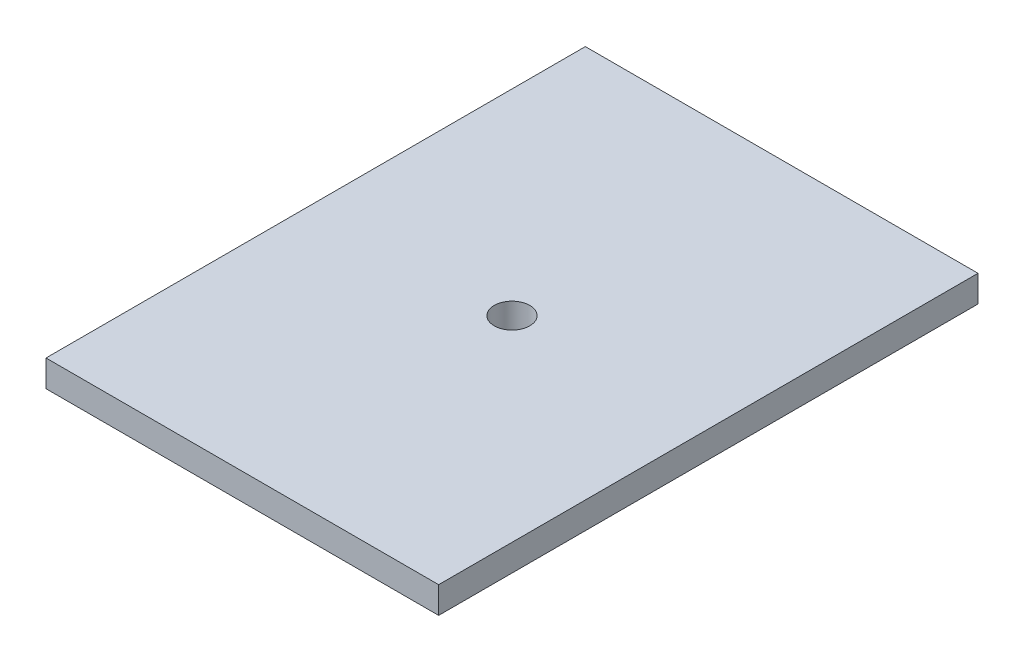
ISO-10303-21;
HEADER;
FILE_DESCRIPTION(('STEP AP214'),'2;1');
FILE_NAME('part.step','',(''),(''),'','','');
FILE_SCHEMA(('AUTOMOTIVE_DESIGN { 1 0 10303 214 1 1 1 1 }'));
ENDSEC;
DATA;
#1=APPLICATION_CONTEXT('core data for automotive mechanical design processes');
#2=APPLICATION_PROTOCOL_DEFINITION('international standard','automotive_design',2000,#1);
#3=PRODUCT_CONTEXT('',#1,'mechanical');
#4=PRODUCT('Part','Part','',(#3));
#5=PRODUCT_RELATED_PRODUCT_CATEGORY('part','',(#4));
#6=PRODUCT_DEFINITION_FORMATION('','',#4);
#7=PRODUCT_DEFINITION_CONTEXT('part definition',#1,'design');
#8=PRODUCT_DEFINITION('design','',#6,#7);
#9=PRODUCT_DEFINITION_SHAPE('','',#8);
#10=(LENGTH_UNIT() NAMED_UNIT(*) SI_UNIT(.MILLI.,.METRE.));
#11=(NAMED_UNIT(*) PLANE_ANGLE_UNIT() SI_UNIT($,.RADIAN.));
#12=(NAMED_UNIT(*) SI_UNIT($,.STERADIAN.) SOLID_ANGLE_UNIT());
#13=UNCERTAINTY_MEASURE_WITH_UNIT(LENGTH_MEASURE(1.E-05),#10,'distance_accuracy_value','');
#14=(GEOMETRIC_REPRESENTATION_CONTEXT(3) GLOBAL_UNCERTAINTY_ASSIGNED_CONTEXT((#13)) GLOBAL_UNIT_ASSIGNED_CONTEXT((#10,
#11,#12)) REPRESENTATION_CONTEXT('',''));
#15=CARTESIAN_POINT('',(0.,0.,0.));
#16=DIRECTION('',(0.,0.,1.));
#17=DIRECTION('',(1.,0.,0.));
#18=AXIS2_PLACEMENT_3D('',#15,#16,#17);
#19=CARTESIAN_POINT('',(22.1190534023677,3.,-30.3827372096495));
#20=DIRECTION('',(-1.,0.,0.));
#21=DIRECTION('',(0.,0.,1.));
#22=AXIS2_PLACEMENT_3D('',#19,#20,#21);
#23=PLANE('',#22);
#24=DIRECTION('',(0.,0.,-1.));
#25=VECTOR('',#24,1.);
#26=CARTESIAN_POINT('',(22.1190534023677,0.,-30.3827372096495));
#27=LINE('',#26,#25);
#28=CARTESIAN_POINT('',(22.1190534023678,0.,30.3827372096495));
#29=VERTEX_POINT('',#28);
#30=CARTESIAN_POINT('',(22.1190534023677,0.,-30.3827372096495));
#31=VERTEX_POINT('',#30);
#32=EDGE_CURVE('E96',#29,#31,#27,.T.);
#33=ORIENTED_EDGE('',*,*,#32,.T.);
#34=DIRECTION('',(0.,-1.,0.));
#35=VECTOR('',#34,1.);
#36=CARTESIAN_POINT('',(22.1190534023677,3.,-30.3827372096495));
#37=LINE('',#36,#35);
#38=CARTESIAN_POINT('',(22.1190534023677,3.,-30.3827372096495));
#39=VERTEX_POINT('',#38);
#40=EDGE_CURVE('E11',#39,#31,#37,.T.);
#41=ORIENTED_EDGE('',*,*,#40,.F.);
#42=DIRECTION('',(0.,0.,-1.));
#43=VECTOR('',#42,1.);
#44=CARTESIAN_POINT('',(22.1190534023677,3.,-30.3827372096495));
#45=LINE('',#44,#43);
#46=CARTESIAN_POINT('',(22.1190534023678,3.,30.3827372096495));
#47=VERTEX_POINT('',#46);
#48=EDGE_CURVE('E84',#47,#39,#45,.T.);
#49=ORIENTED_EDGE('',*,*,#48,.F.);
#50=DIRECTION('',(0.,-1.,0.));
#51=VECTOR('',#50,1.);
#52=CARTESIAN_POINT('',(22.1190534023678,3.,30.3827372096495));
#53=LINE('',#52,#51);
#54=EDGE_CURVE('E92',#47,#29,#53,.T.);
#55=ORIENTED_EDGE('',*,*,#54,.T.);
#56=EDGE_LOOP('',(#33,#41,#49,#55));
#57=FACE_BOUND('',#56,.T.);
#58=ADVANCED_FACE('F33',(#57),#23,.F.);
#59=CARTESIAN_POINT('',(-22.1190534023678,3.,-30.3827372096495));
#60=DIRECTION('',(0.,0.,1.));
#61=DIRECTION('',(1.,0.,0.));
#62=AXIS2_PLACEMENT_3D('',#59,#60,#61);
#63=PLANE('',#62);
#64=DIRECTION('',(-1.,0.,0.));
#65=VECTOR('',#64,1.);
#66=CARTESIAN_POINT('',(-22.1190534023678,0.,-30.3827372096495));
#67=LINE('',#66,#65);
#68=CARTESIAN_POINT('',(-22.1190534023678,0.,-30.3827372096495));
#69=VERTEX_POINT('',#68);
#70=EDGE_CURVE('E88',#31,#69,#67,.T.);
#71=ORIENTED_EDGE('',*,*,#70,.T.);
#72=DIRECTION('',(0.,-1.,0.));
#73=VECTOR('',#72,1.);
#74=CARTESIAN_POINT('',(-22.1190534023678,3.,-30.3827372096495));
#75=LINE('',#74,#73);
#76=CARTESIAN_POINT('',(-22.1190534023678,3.,-30.3827372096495));
#77=VERTEX_POINT('',#76);
#78=EDGE_CURVE('E41',#77,#69,#75,.T.);
#79=ORIENTED_EDGE('',*,*,#78,.F.);
#80=DIRECTION('',(-1.,0.,0.));
#81=VECTOR('',#80,1.);
#82=CARTESIAN_POINT('',(-22.1190534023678,3.,-30.3827372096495));
#83=LINE('',#82,#81);
#84=EDGE_CURVE('E79',#39,#77,#83,.T.);
#85=ORIENTED_EDGE('',*,*,#84,.F.);
#86=ORIENTED_EDGE('',*,*,#40,.T.);
#87=EDGE_LOOP('',(#71,#79,#85,#86));
#88=FACE_BOUND('',#87,.T.);
#89=ADVANCED_FACE('F87',(#88),#63,.F.);
#90=CARTESIAN_POINT('',(-22.1190534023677,3.,30.3827372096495));
#91=DIRECTION('',(1.,0.,0.));
#92=DIRECTION('',(0.,0.,-1.));
#93=AXIS2_PLACEMENT_3D('',#90,#91,#92);
#94=PLANE('',#93);
#95=DIRECTION('',(0.,0.,1.));
#96=VECTOR('',#95,1.);
#97=CARTESIAN_POINT('',(-22.1190534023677,0.,30.3827372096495));
#98=LINE('',#97,#96);
#99=CARTESIAN_POINT('',(-22.1190534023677,0.,30.3827372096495));
#100=VERTEX_POINT('',#99);
#101=EDGE_CURVE('E66',#69,#100,#98,.T.);
#102=ORIENTED_EDGE('',*,*,#101,.T.);
#103=DIRECTION('',(0.,-1.,0.));
#104=VECTOR('',#103,1.);
#105=CARTESIAN_POINT('',(-22.1190534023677,3.,30.3827372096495));
#106=LINE('',#105,#104);
#107=CARTESIAN_POINT('',(-22.1190534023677,3.,30.3827372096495));
#108=VERTEX_POINT('',#107);
#109=EDGE_CURVE('E89',#108,#100,#106,.T.);
#110=ORIENTED_EDGE('',*,*,#109,.F.);
#111=DIRECTION('',(0.,0.,1.));
#112=VECTOR('',#111,1.);
#113=CARTESIAN_POINT('',(-22.1190534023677,3.,30.3827372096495));
#114=LINE('',#113,#112);
#115=EDGE_CURVE('E82',#77,#108,#114,.T.);
#116=ORIENTED_EDGE('',*,*,#115,.F.);
#117=ORIENTED_EDGE('',*,*,#78,.T.);
#118=EDGE_LOOP('',(#102,#110,#116,#117));
#119=FACE_BOUND('',#118,.T.);
#120=ADVANCED_FACE('F90',(#119),#94,.F.);
#121=CARTESIAN_POINT('',(-22.1190534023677,3.,30.3827372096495));
#122=DIRECTION('',(0.,0.,-1.));
#123=DIRECTION('',(-1.,0.,0.));
#124=AXIS2_PLACEMENT_3D('',#121,#122,#123);
#125=PLANE('',#124);
#126=DIRECTION('',(1.,0.,0.));
#127=VECTOR('',#126,1.);
#128=CARTESIAN_POINT('',(-22.1190534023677,0.,30.3827372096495));
#129=LINE('',#128,#127);
#130=EDGE_CURVE('E72',#100,#29,#129,.T.);
#131=ORIENTED_EDGE('',*,*,#130,.T.);
#132=ORIENTED_EDGE('',*,*,#54,.F.);
#133=DIRECTION('',(1.,0.,0.));
#134=VECTOR('',#133,1.);
#135=CARTESIAN_POINT('',(-22.1190534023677,3.,30.3827372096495));
#136=LINE('',#135,#134);
#137=EDGE_CURVE('E49',#108,#47,#136,.T.);
#138=ORIENTED_EDGE('',*,*,#137,.F.);
#139=ORIENTED_EDGE('',*,*,#109,.T.);
#140=EDGE_LOOP('',(#131,#132,#138,#139));
#141=FACE_BOUND('',#140,.T.);
#142=ADVANCED_FACE('F104',(#141),#125,.F.);
#143=CARTESIAN_POINT('',(22.1190534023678,3.,30.3827372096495));
#144=DIRECTION('',(0.,1.,0.));
#145=DIRECTION('',(0.,0.,1.));
#146=AXIS2_PLACEMENT_3D('',#143,#144,#145);
#147=PLANE('',#146);
#148=CARTESIAN_POINT('',(0.,3.,0.));
#149=DIRECTION('',(0.,1.,0.));
#150=DIRECTION('',(0.,0.,1.));
#151=AXIS2_PLACEMENT_3D('',#148,#149,#150);
#152=CIRCLE('',#151,1.99999999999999);
#153=CARTESIAN_POINT('',(0.,3.,1.99999999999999));
#154=VERTEX_POINT('',#153);
#155=EDGE_CURVE('E99',#154,#154,#152,.T.);
#156=ORIENTED_EDGE('',*,*,#155,.F.);
#157=EDGE_LOOP('',(#156));
#158=FACE_BOUND('',#157,.T.);
#159=ORIENTED_EDGE('',*,*,#48,.T.);
#160=ORIENTED_EDGE('',*,*,#84,.T.);
#161=ORIENTED_EDGE('',*,*,#115,.T.);
#162=ORIENTED_EDGE('',*,*,#137,.T.);
#163=EDGE_LOOP('',(#159,#160,#161,#162));
#164=FACE_BOUND('',#163,.T.);
#165=ADVANCED_FACE('F80',(#158,#164),#147,.T.);
#166=CARTESIAN_POINT('',(22.1190534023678,0.,30.3827372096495));
#167=DIRECTION('',(0.,1.,0.));
#168=DIRECTION('',(0.,0.,1.));
#169=AXIS2_PLACEMENT_3D('',#166,#167,#168);
#170=PLANE('',#169);
#171=CARTESIAN_POINT('',(0.,0.,0.));
#172=DIRECTION('',(0.,-1.,0.));
#173=DIRECTION('',(0.,0.,-1.));
#174=AXIS2_PLACEMENT_3D('',#171,#172,#173);
#175=CIRCLE('',#174,1.99999999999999);
#176=CARTESIAN_POINT('',(0.,0.,-1.99999999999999));
#177=VERTEX_POINT('',#176);
#178=EDGE_CURVE('E112',#177,#177,#175,.T.);
#179=ORIENTED_EDGE('',*,*,#178,.F.);
#180=EDGE_LOOP('',(#179));
#181=FACE_BOUND('',#180,.T.);
#182=ORIENTED_EDGE('',*,*,#32,.F.);
#183=ORIENTED_EDGE('',*,*,#130,.F.);
#184=ORIENTED_EDGE('',*,*,#101,.F.);
#185=ORIENTED_EDGE('',*,*,#70,.F.);
#186=EDGE_LOOP('',(#182,#183,#184,#185));
#187=FACE_BOUND('',#186,.T.);
#188=ADVANCED_FACE('F107',(#181,#187),#170,.F.);
#189=CARTESIAN_POINT('',(0.,20.,0.));
#190=DIRECTION('',(0.,-1.,0.));
#191=DIRECTION('',(0.,0.,-1.));
#192=AXIS2_PLACEMENT_3D('',#189,#190,#191);
#193=CYLINDRICAL_SURFACE('',#192,1.99999999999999);
#194=ORIENTED_EDGE('',*,*,#155,.T.);
#195=EDGE_LOOP('',(#194));
#196=FACE_BOUND('',#195,.T.);
#197=ORIENTED_EDGE('',*,*,#178,.T.);
#198=EDGE_LOOP('',(#197));
#199=FACE_BOUND('',#198,.T.);
#200=ADVANCED_FACE('F116',(#196,#199),#193,.F.);
#201=CLOSED_SHELL('',(#58,#89,#120,#142,#165,#188,#200));
#202=MANIFOLD_SOLID_BREP('B2',#201);
#203=ADVANCED_BREP_SHAPE_REPRESENTATION('',(#18,#202),#14);
#204=SHAPE_DEFINITION_REPRESENTATION(#9,#203);
ENDSEC;
END-ISO-10303-21;
